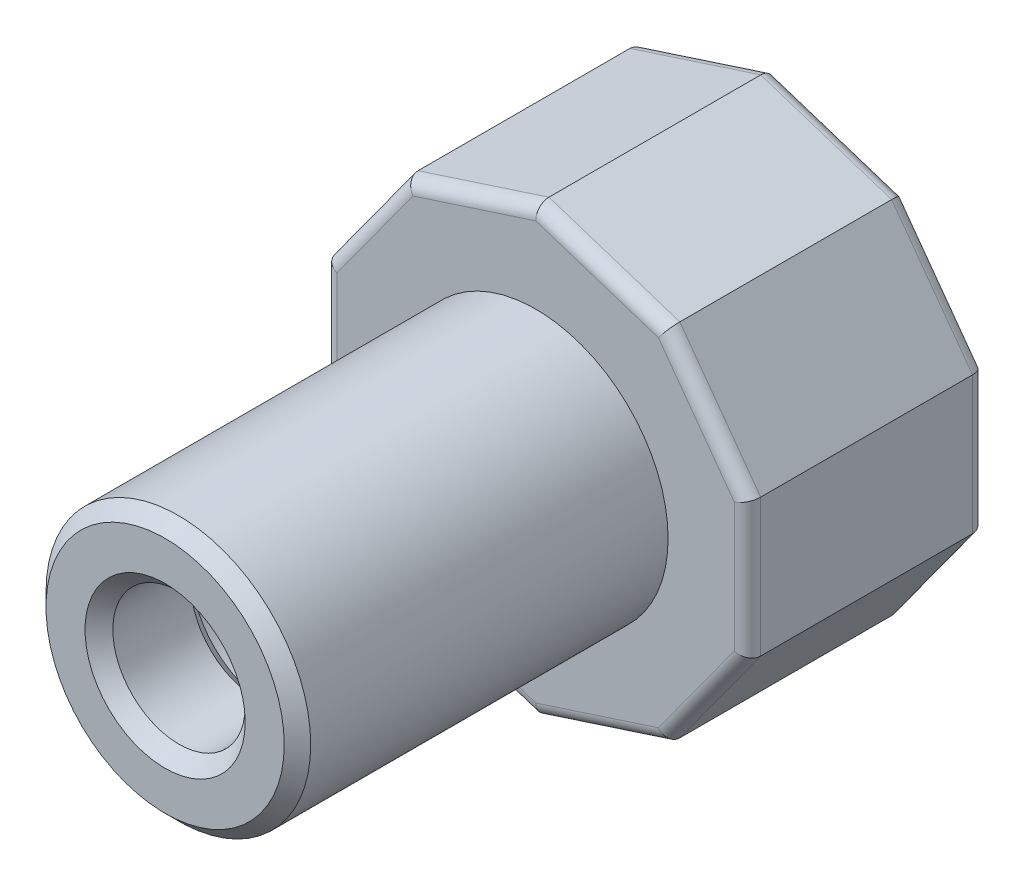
ISO-10303-21;
HEADER;
FILE_DESCRIPTION(('STEP AP214'),'2;1');
FILE_NAME('part.step','',(''),(''),'','','');
FILE_SCHEMA(('AUTOMOTIVE_DESIGN { 1 0 10303 214 1 1 1 1 }'));
ENDSEC;
DATA;
#1=APPLICATION_CONTEXT('core data for automotive mechanical design processes');
#2=APPLICATION_PROTOCOL_DEFINITION('international standard','automotive_design',2000,#1);
#3=PRODUCT_CONTEXT('',#1,'mechanical');
#4=PRODUCT('Part','Part','',(#3));
#5=PRODUCT_RELATED_PRODUCT_CATEGORY('part','',(#4));
#6=PRODUCT_DEFINITION_FORMATION('','',#4);
#7=PRODUCT_DEFINITION_CONTEXT('part definition',#1,'design');
#8=PRODUCT_DEFINITION('design','',#6,#7);
#9=PRODUCT_DEFINITION_SHAPE('','',#8);
#10=(LENGTH_UNIT() NAMED_UNIT(*) SI_UNIT(.MILLI.,.METRE.));
#11=(NAMED_UNIT(*) PLANE_ANGLE_UNIT() SI_UNIT($,.RADIAN.));
#12=(NAMED_UNIT(*) SI_UNIT($,.STERADIAN.) SOLID_ANGLE_UNIT());
#13=UNCERTAINTY_MEASURE_WITH_UNIT(LENGTH_MEASURE(1.E-05),#10,'distance_accuracy_value','');
#14=(GEOMETRIC_REPRESENTATION_CONTEXT(3) GLOBAL_UNCERTAINTY_ASSIGNED_CONTEXT((#13)) GLOBAL_UNIT_ASSIGNED_CONTEXT((#10,
#11,#12)) REPRESENTATION_CONTEXT('',''));
#15=CARTESIAN_POINT('',(0.,0.,0.));
#16=DIRECTION('',(0.,0.,1.));
#17=DIRECTION('',(1.,0.,0.));
#18=AXIS2_PLACEMENT_3D('',#15,#16,#17);
#19=CARTESIAN_POINT('',(0.,-8.41169779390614,9.));
#20=DIRECTION('',(-0.309016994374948,0.951056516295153,0.));
#21=DIRECTION('',(-0.951056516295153,-0.309016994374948,0.));
#22=AXIS2_PLACEMENT_3D('',#19,#20,#21);
#23=PLANE('',#22);
#24=DIRECTION('',(0.,0.,-1.));
#25=VECTOR('',#24,1.);
#26=CARTESIAN_POINT('',(4.94427190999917,-6.80520646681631,9.));
#27=LINE('',#26,#25);
#28=CARTESIAN_POINT('',(4.94427190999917,-6.80520646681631,8.5));
#29=VERTEX_POINT('',#28);
#30=CARTESIAN_POINT('',(4.94427190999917,-6.80520646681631,0.5));
#31=VERTEX_POINT('',#30);
#32=EDGE_CURVE('E322',#29,#31,#27,.T.);
#33=ORIENTED_EDGE('',*,*,#32,.F.);
#34=DIRECTION('',(0.951056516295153,0.309016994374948,0.));
#35=VECTOR('',#34,1.);
#36=CARTESIAN_POINT('',(0.,-8.41169779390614,8.5));
#37=LINE('',#36,#35);
#38=CARTESIAN_POINT('',(0.,-8.41169779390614,8.5));
#39=VERTEX_POINT('',#38);
#40=EDGE_CURVE('E266',#29,#39,#37,.F.);
#41=ORIENTED_EDGE('',*,*,#40,.T.);
#42=DIRECTION('',(0.,0.,-1.));
#43=VECTOR('',#42,1.);
#44=CARTESIAN_POINT('',(0.,-8.41169779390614,9.));
#45=LINE('',#44,#43);
#46=CARTESIAN_POINT('',(0.,-8.41169779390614,0.5));
#47=VERTEX_POINT('',#46);
#48=EDGE_CURVE('E323',#39,#47,#45,.T.);
#49=ORIENTED_EDGE('',*,*,#48,.T.);
#50=DIRECTION('',(0.951056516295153,0.309016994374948,0.));
#51=VECTOR('',#50,1.);
#52=CARTESIAN_POINT('',(0.,-8.41169779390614,0.5));
#53=LINE('',#52,#51);
#54=EDGE_CURVE('E272',#47,#31,#53,.T.);
#55=ORIENTED_EDGE('',*,*,#54,.T.);
#56=EDGE_LOOP('',(#33,#41,#49,#55));
#57=FACE_BOUND('',#56,.T.);
#58=ADVANCED_FACE('F35',(#57),#23,.F.);
#59=CARTESIAN_POINT('',(4.94427190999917,-6.80520646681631,9.));
#60=DIRECTION('',(-0.809016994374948,0.587785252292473,0.));
#61=DIRECTION('',(-0.587785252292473,-0.809016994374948,0.));
#62=AXIS2_PLACEMENT_3D('',#59,#60,#61);
#63=PLANE('',#62);
#64=DIRECTION('',(0.,0.,-1.));
#65=VECTOR('',#64,1.);
#66=CARTESIAN_POINT('',(8.,-2.59935756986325,9.));
#67=LINE('',#66,#65);
#68=CARTESIAN_POINT('',(8.,-2.59935756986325,8.5));
#69=VERTEX_POINT('',#68);
#70=CARTESIAN_POINT('',(8.,-2.59935756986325,0.5));
#71=VERTEX_POINT('',#70);
#72=EDGE_CURVE('E329',#69,#71,#67,.T.);
#73=ORIENTED_EDGE('',*,*,#72,.F.);
#74=DIRECTION('',(0.587785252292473,0.809016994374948,0.));
#75=VECTOR('',#74,1.);
#76=CARTESIAN_POINT('',(4.94427190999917,-6.80520646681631,8.5));
#77=LINE('',#76,#75);
#78=EDGE_CURVE('E201',#69,#29,#77,.F.);
#79=ORIENTED_EDGE('',*,*,#78,.T.);
#80=ORIENTED_EDGE('',*,*,#32,.T.);
#81=DIRECTION('',(0.587785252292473,0.809016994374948,0.));
#82=VECTOR('',#81,1.);
#83=CARTESIAN_POINT('',(4.94427190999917,-6.80520646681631,0.5));
#84=LINE('',#83,#82);
#85=EDGE_CURVE('E271',#31,#71,#84,.T.);
#86=ORIENTED_EDGE('',*,*,#85,.T.);
#87=EDGE_LOOP('',(#73,#79,#80,#86));
#88=FACE_BOUND('',#87,.T.);
#89=ADVANCED_FACE('F326',(#88),#63,.F.);
#90=CARTESIAN_POINT('',(8.,-2.59935756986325,9.));
#91=DIRECTION('',(-1.,0.,0.));
#92=DIRECTION('',(0.,0.,1.));
#93=AXIS2_PLACEMENT_3D('',#90,#91,#92);
#94=PLANE('',#93);
#95=DIRECTION('',(0.,0.,-1.));
#96=VECTOR('',#95,1.);
#97=CARTESIAN_POINT('',(8.,2.59935756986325,9.));
#98=LINE('',#97,#96);
#99=CARTESIAN_POINT('',(8.,2.59935756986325,8.5));
#100=VERTEX_POINT('',#99);
#101=CARTESIAN_POINT('',(8.,2.59935756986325,0.5));
#102=VERTEX_POINT('',#101);
#103=EDGE_CURVE('E334',#100,#102,#98,.T.);
#104=ORIENTED_EDGE('',*,*,#103,.F.);
#105=DIRECTION('',(0.,1.,0.));
#106=VECTOR('',#105,1.);
#107=CARTESIAN_POINT('',(8.,-2.59935756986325,8.5));
#108=LINE('',#107,#106);
#109=EDGE_CURVE('E291',#100,#69,#108,.F.);
#110=ORIENTED_EDGE('',*,*,#109,.T.);
#111=ORIENTED_EDGE('',*,*,#72,.T.);
#112=DIRECTION('',(0.,1.,0.));
#113=VECTOR('',#112,1.);
#114=CARTESIAN_POINT('',(8.,-2.59935756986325,0.5));
#115=LINE('',#114,#113);
#116=EDGE_CURVE('E288',#71,#102,#115,.T.);
#117=ORIENTED_EDGE('',*,*,#116,.T.);
#118=EDGE_LOOP('',(#104,#110,#111,#117));
#119=FACE_BOUND('',#118,.T.);
#120=ADVANCED_FACE('F413',(#119),#94,.F.);
#121=CARTESIAN_POINT('',(8.,2.59935756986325,9.));
#122=DIRECTION('',(-0.809016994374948,-0.587785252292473,0.));
#123=DIRECTION('',(0.587785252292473,-0.809016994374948,0.));
#124=AXIS2_PLACEMENT_3D('',#121,#122,#123);
#125=PLANE('',#124);
#126=DIRECTION('',(0.,0.,-1.));
#127=VECTOR('',#126,1.);
#128=CARTESIAN_POINT('',(4.94427190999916,6.80520646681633,9.));
#129=LINE('',#128,#127);
#130=CARTESIAN_POINT('',(4.94427190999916,6.80520646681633,8.5));
#131=VERTEX_POINT('',#130);
#132=CARTESIAN_POINT('',(4.94427190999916,6.80520646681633,0.5));
#133=VERTEX_POINT('',#132);
#134=EDGE_CURVE('E394',#131,#133,#129,.T.);
#135=ORIENTED_EDGE('',*,*,#134,.F.);
#136=DIRECTION('',(-0.587785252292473,0.809016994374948,0.));
#137=VECTOR('',#136,1.);
#138=CARTESIAN_POINT('',(8.,2.59935756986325,8.5));
#139=LINE('',#138,#137);
#140=EDGE_CURVE('E286',#131,#100,#139,.F.);
#141=ORIENTED_EDGE('',*,*,#140,.T.);
#142=ORIENTED_EDGE('',*,*,#103,.T.);
#143=DIRECTION('',(-0.587785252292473,0.809016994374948,0.));
#144=VECTOR('',#143,1.);
#145=CARTESIAN_POINT('',(8.,2.59935756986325,0.5));
#146=LINE('',#145,#144);
#147=EDGE_CURVE('E284',#102,#133,#146,.T.);
#148=ORIENTED_EDGE('',*,*,#147,.T.);
#149=EDGE_LOOP('',(#135,#141,#142,#148));
#150=FACE_BOUND('',#149,.T.);
#151=ADVANCED_FACE('F411',(#150),#125,.F.);
#152=CARTESIAN_POINT('',(4.94427190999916,6.80520646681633,9.));
#153=DIRECTION('',(-0.309016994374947,-0.951056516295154,0.));
#154=DIRECTION('',(0.951056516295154,-0.309016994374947,0.));
#155=AXIS2_PLACEMENT_3D('',#152,#153,#154);
#156=PLANE('',#155);
#157=DIRECTION('',(0.,0.,-1.));
#158=VECTOR('',#157,1.);
#159=CARTESIAN_POINT('',(0.,8.41169779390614,9.));
#160=LINE('',#159,#158);
#161=CARTESIAN_POINT('',(0.,8.41169779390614,8.5));
#162=VERTEX_POINT('',#161);
#163=CARTESIAN_POINT('',(0.,8.41169779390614,0.5));
#164=VERTEX_POINT('',#163);
#165=EDGE_CURVE('E382',#162,#164,#160,.T.);
#166=ORIENTED_EDGE('',*,*,#165,.F.);
#167=DIRECTION('',(-0.951056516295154,0.309016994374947,0.));
#168=VECTOR('',#167,1.);
#169=CARTESIAN_POINT('',(4.94427190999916,6.80520646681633,8.5));
#170=LINE('',#169,#168);
#171=EDGE_CURVE('E282',#162,#131,#170,.F.);
#172=ORIENTED_EDGE('',*,*,#171,.T.);
#173=ORIENTED_EDGE('',*,*,#134,.T.);
#174=DIRECTION('',(-0.951056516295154,0.309016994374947,0.));
#175=VECTOR('',#174,1.);
#176=CARTESIAN_POINT('',(4.94427190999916,6.80520646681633,0.5));
#177=LINE('',#176,#175);
#178=EDGE_CURVE('E280',#133,#164,#177,.T.);
#179=ORIENTED_EDGE('',*,*,#178,.T.);
#180=EDGE_LOOP('',(#166,#172,#173,#179));
#181=FACE_BOUND('',#180,.T.);
#182=ADVANCED_FACE('F390',(#181),#156,.F.);
#183=CARTESIAN_POINT('',(0.,8.41169779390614,9.));
#184=DIRECTION('',(0.309016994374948,-0.951056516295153,0.));
#185=DIRECTION('',(0.951056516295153,0.309016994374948,0.));
#186=AXIS2_PLACEMENT_3D('',#183,#184,#185);
#187=PLANE('',#186);
#188=DIRECTION('',(0.,0.,-1.));
#189=VECTOR('',#188,1.);
#190=CARTESIAN_POINT('',(-4.94427190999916,6.80520646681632,9.));
#191=LINE('',#190,#189);
#192=CARTESIAN_POINT('',(-4.94427190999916,6.80520646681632,8.5));
#193=VERTEX_POINT('',#192);
#194=CARTESIAN_POINT('',(-4.94427190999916,6.80520646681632,0.5));
#195=VERTEX_POINT('',#194);
#196=EDGE_CURVE('E385',#193,#195,#191,.T.);
#197=ORIENTED_EDGE('',*,*,#196,.F.);
#198=DIRECTION('',(-0.951056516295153,-0.309016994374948,0.));
#199=VECTOR('',#198,1.);
#200=CARTESIAN_POINT('',(0.,8.41169779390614,8.5));
#201=LINE('',#200,#199);
#202=EDGE_CURVE('E275',#193,#162,#201,.F.);
#203=ORIENTED_EDGE('',*,*,#202,.T.);
#204=ORIENTED_EDGE('',*,*,#165,.T.);
#205=DIRECTION('',(-0.951056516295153,-0.309016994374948,0.));
#206=VECTOR('',#205,1.);
#207=CARTESIAN_POINT('',(0.,8.41169779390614,0.5));
#208=LINE('',#207,#206);
#209=EDGE_CURVE('E375',#164,#195,#208,.T.);
#210=ORIENTED_EDGE('',*,*,#209,.T.);
#211=EDGE_LOOP('',(#197,#203,#204,#210));
#212=FACE_BOUND('',#211,.T.);
#213=ADVANCED_FACE('F381',(#212),#187,.F.);
#214=CARTESIAN_POINT('',(-4.94427190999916,6.80520646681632,9.));
#215=DIRECTION('',(0.809016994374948,-0.587785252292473,0.));
#216=DIRECTION('',(0.587785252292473,0.809016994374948,0.));
#217=AXIS2_PLACEMENT_3D('',#214,#215,#216);
#218=PLANE('',#217);
#219=DIRECTION('',(0.,0.,-1.));
#220=VECTOR('',#219,1.);
#221=CARTESIAN_POINT('',(-8.,2.59935756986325,9.));
#222=LINE('',#221,#220);
#223=CARTESIAN_POINT('',(-8.,2.59935756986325,8.5));
#224=VERTEX_POINT('',#223);
#225=CARTESIAN_POINT('',(-8.,2.59935756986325,0.5));
#226=VERTEX_POINT('',#225);
#227=EDGE_CURVE('E417',#224,#226,#222,.T.);
#228=ORIENTED_EDGE('',*,*,#227,.F.);
#229=DIRECTION('',(-0.587785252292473,-0.809016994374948,0.));
#230=VECTOR('',#229,1.);
#231=CARTESIAN_POINT('',(-4.94427190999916,6.80520646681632,8.5));
#232=LINE('',#231,#230);
#233=EDGE_CURVE('E373',#224,#193,#232,.F.);
#234=ORIENTED_EDGE('',*,*,#233,.T.);
#235=ORIENTED_EDGE('',*,*,#196,.T.);
#236=DIRECTION('',(-0.587785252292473,-0.809016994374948,0.));
#237=VECTOR('',#236,1.);
#238=CARTESIAN_POINT('',(-4.94427190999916,6.80520646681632,0.5));
#239=LINE('',#238,#237);
#240=EDGE_CURVE('E371',#195,#226,#239,.T.);
#241=ORIENTED_EDGE('',*,*,#240,.T.);
#242=EDGE_LOOP('',(#228,#234,#235,#241));
#243=FACE_BOUND('',#242,.T.);
#244=ADVANCED_FACE('F578',(#243),#218,.F.);
#245=CARTESIAN_POINT('',(-8.,2.59935756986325,9.));
#246=DIRECTION('',(1.,0.,0.));
#247=DIRECTION('',(0.,0.,-1.));
#248=AXIS2_PLACEMENT_3D('',#245,#246,#247);
#249=PLANE('',#248);
#250=DIRECTION('',(0.,0.,-1.));
#251=VECTOR('',#250,1.);
#252=CARTESIAN_POINT('',(-8.,-2.59935756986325,9.));
#253=LINE('',#252,#251);
#254=CARTESIAN_POINT('',(-8.,-2.59935756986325,8.5));
#255=VERTEX_POINT('',#254);
#256=CARTESIAN_POINT('',(-8.,-2.59935756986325,0.5));
#257=VERTEX_POINT('',#256);
#258=EDGE_CURVE('E420',#255,#257,#253,.T.);
#259=ORIENTED_EDGE('',*,*,#258,.F.);
#260=DIRECTION('',(0.,-1.,0.));
#261=VECTOR('',#260,1.);
#262=CARTESIAN_POINT('',(-8.,2.59935756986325,8.5));
#263=LINE('',#262,#261);
#264=EDGE_CURVE('E369',#255,#224,#263,.F.);
#265=ORIENTED_EDGE('',*,*,#264,.T.);
#266=ORIENTED_EDGE('',*,*,#227,.T.);
#267=DIRECTION('',(0.,-1.,0.));
#268=VECTOR('',#267,1.);
#269=CARTESIAN_POINT('',(-8.,2.59935756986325,0.5));
#270=LINE('',#269,#268);
#271=EDGE_CURVE('E367',#226,#257,#270,.T.);
#272=ORIENTED_EDGE('',*,*,#271,.T.);
#273=EDGE_LOOP('',(#259,#265,#266,#272));
#274=FACE_BOUND('',#273,.T.);
#275=ADVANCED_FACE('F570',(#274),#249,.F.);
#276=CARTESIAN_POINT('',(-8.,-2.59935756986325,9.));
#277=DIRECTION('',(0.809016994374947,0.587785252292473,0.));
#278=DIRECTION('',(-0.587785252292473,0.809016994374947,0.));
#279=AXIS2_PLACEMENT_3D('',#276,#277,#278);
#280=PLANE('',#279);
#281=DIRECTION('',(0.,0.,-1.));
#282=VECTOR('',#281,1.);
#283=CARTESIAN_POINT('',(-4.94427190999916,-6.80520646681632,9.));
#284=LINE('',#283,#282);
#285=CARTESIAN_POINT('',(-4.94427190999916,-6.80520646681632,8.5));
#286=VERTEX_POINT('',#285);
#287=CARTESIAN_POINT('',(-4.94427190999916,-6.80520646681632,0.5));
#288=VERTEX_POINT('',#287);
#289=EDGE_CURVE('E423',#286,#288,#284,.T.);
#290=ORIENTED_EDGE('',*,*,#289,.F.);
#291=DIRECTION('',(0.587785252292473,-0.809016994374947,0.));
#292=VECTOR('',#291,1.);
#293=CARTESIAN_POINT('',(-8.,-2.59935756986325,8.5));
#294=LINE('',#293,#292);
#295=EDGE_CURVE('E365',#286,#255,#294,.F.);
#296=ORIENTED_EDGE('',*,*,#295,.T.);
#297=ORIENTED_EDGE('',*,*,#258,.T.);
#298=DIRECTION('',(0.587785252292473,-0.809016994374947,0.));
#299=VECTOR('',#298,1.);
#300=CARTESIAN_POINT('',(-8.,-2.59935756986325,0.5));
#301=LINE('',#300,#299);
#302=EDGE_CURVE('E363',#257,#288,#301,.T.);
#303=ORIENTED_EDGE('',*,*,#302,.T.);
#304=EDGE_LOOP('',(#290,#296,#297,#303));
#305=FACE_BOUND('',#304,.T.);
#306=ADVANCED_FACE('F565',(#305),#280,.F.);
#307=CARTESIAN_POINT('',(-4.94427190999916,-6.80520646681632,9.));
#308=DIRECTION('',(0.309016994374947,0.951056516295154,0.));
#309=DIRECTION('',(-0.951056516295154,0.309016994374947,0.));
#310=AXIS2_PLACEMENT_3D('',#307,#308,#309);
#311=PLANE('',#310);
#312=ORIENTED_EDGE('',*,*,#48,.F.);
#313=DIRECTION('',(0.951056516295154,-0.309016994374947,0.));
#314=VECTOR('',#313,1.);
#315=CARTESIAN_POINT('',(-4.94427190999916,-6.80520646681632,8.5));
#316=LINE('',#315,#314);
#317=EDGE_CURVE('E360',#39,#286,#316,.F.);
#318=ORIENTED_EDGE('',*,*,#317,.T.);
#319=ORIENTED_EDGE('',*,*,#289,.T.);
#320=DIRECTION('',(0.951056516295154,-0.309016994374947,0.));
#321=VECTOR('',#320,1.);
#322=CARTESIAN_POINT('',(-4.94427190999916,-6.80520646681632,0.5));
#323=LINE('',#322,#321);
#324=EDGE_CURVE('E358',#288,#47,#323,.T.);
#325=ORIENTED_EDGE('',*,*,#324,.T.);
#326=EDGE_LOOP('',(#312,#318,#319,#325));
#327=FACE_BOUND('',#326,.T.);
#328=ADVANCED_FACE('F562',(#327),#311,.F.);
#329=CARTESIAN_POINT('',(0.,0.,9.));
#330=DIRECTION('',(0.,0.,1.));
#331=DIRECTION('',(1.,0.,0.));
#332=AXIS2_PLACEMENT_3D('',#329,#330,#331);
#333=PLANE('',#332);
#334=DIRECTION('',(0.587785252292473,-0.809016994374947,0.));
#335=VECTOR('',#334,1.);
#336=CARTESIAN_POINT('',(-4.53976341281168,-6.51131384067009,9.));
#337=LINE('',#336,#335);
#338=CARTESIAN_POINT('',(-7.5,-2.4368977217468,9.));
#339=VERTEX_POINT('',#338);
#340=CARTESIAN_POINT('',(-4.63525491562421,-6.3798810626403,9.));
#341=VERTEX_POINT('',#340);
#342=EDGE_CURVE('E354',#339,#341,#337,.T.);
#343=ORIENTED_EDGE('',*,*,#342,.T.);
#344=DIRECTION('',(0.951056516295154,-0.309016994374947,0.));
#345=VECTOR('',#344,1.);
#346=CARTESIAN_POINT('',(0.154508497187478,-7.93616953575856,9.));
#347=LINE('',#346,#345);
#348=CARTESIAN_POINT('',(0.,-7.885966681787,9.));
#349=VERTEX_POINT('',#348);
#350=EDGE_CURVE('E356',#341,#349,#347,.T.);
#351=ORIENTED_EDGE('',*,*,#350,.T.);
#352=DIRECTION('',(0.951056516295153,0.309016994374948,0.));
#353=VECTOR('',#352,1.);
#354=CARTESIAN_POINT('',(4.78976341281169,-6.32967820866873,9.));
#355=LINE('',#354,#353);
#356=CARTESIAN_POINT('',(4.63525491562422,-6.37988106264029,9.));
#357=VERTEX_POINT('',#356);
#358=EDGE_CURVE('E181',#349,#357,#355,.T.);
#359=ORIENTED_EDGE('',*,*,#358,.T.);
#360=DIRECTION('',(0.587785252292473,0.809016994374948,0.));
#361=VECTOR('',#360,1.);
#362=CARTESIAN_POINT('',(7.59549150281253,-2.30546494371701,9.));
#363=LINE('',#362,#361);
#364=CARTESIAN_POINT('',(7.5,-2.4368977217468,9.));
#365=VERTEX_POINT('',#364);
#366=EDGE_CURVE('E173',#357,#365,#363,.T.);
#367=ORIENTED_EDGE('',*,*,#366,.T.);
#368=DIRECTION('',(0.,1.,0.));
#369=VECTOR('',#368,1.);
#370=CARTESIAN_POINT('',(7.5,2.59935756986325,9.));
#371=LINE('',#370,#369);
#372=CARTESIAN_POINT('',(7.5,2.4368977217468,9.));
#373=VERTEX_POINT('',#372);
#374=EDGE_CURVE('E177',#365,#373,#371,.T.);
#375=ORIENTED_EDGE('',*,*,#374,.T.);
#376=DIRECTION('',(-0.587785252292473,0.809016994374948,0.));
#377=VECTOR('',#376,1.);
#378=CARTESIAN_POINT('',(4.53976341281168,6.51131384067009,9.));
#379=LINE('',#378,#377);
#380=CARTESIAN_POINT('',(4.63525491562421,6.37988106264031,9.));
#381=VERTEX_POINT('',#380);
#382=EDGE_CURVE('E197',#373,#381,#379,.T.);
#383=ORIENTED_EDGE('',*,*,#382,.T.);
#384=DIRECTION('',(-0.951056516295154,0.309016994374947,0.));
#385=VECTOR('',#384,1.);
#386=CARTESIAN_POINT('',(-0.154508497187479,7.93616953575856,9.));
#387=LINE('',#386,#385);
#388=CARTESIAN_POINT('',(0.,7.88596668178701,9.));
#389=VERTEX_POINT('',#388);
#390=EDGE_CURVE('E186',#381,#389,#387,.T.);
#391=ORIENTED_EDGE('',*,*,#390,.T.);
#392=DIRECTION('',(-0.951056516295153,-0.309016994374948,0.));
#393=VECTOR('',#392,1.);
#394=CARTESIAN_POINT('',(-4.78976341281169,6.32967820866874,9.));
#395=LINE('',#394,#393);
#396=CARTESIAN_POINT('',(-4.63525491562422,6.3798810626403,9.));
#397=VERTEX_POINT('',#396);
#398=EDGE_CURVE('E348',#389,#397,#395,.T.);
#399=ORIENTED_EDGE('',*,*,#398,.T.);
#400=DIRECTION('',(-0.587785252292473,-0.809016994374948,0.));
#401=VECTOR('',#400,1.);
#402=CARTESIAN_POINT('',(-7.59549150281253,2.30546494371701,9.));
#403=LINE('',#402,#401);
#404=CARTESIAN_POINT('',(-7.5,2.4368977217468,9.));
#405=VERTEX_POINT('',#404);
#406=EDGE_CURVE('E350',#397,#405,#403,.T.);
#407=ORIENTED_EDGE('',*,*,#406,.T.);
#408=DIRECTION('',(0.,-1.,0.));
#409=VECTOR('',#408,1.);
#410=CARTESIAN_POINT('',(-7.5,-2.59935756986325,9.));
#411=LINE('',#410,#409);
#412=EDGE_CURVE('E352',#405,#339,#411,.T.);
#413=ORIENTED_EDGE('',*,*,#412,.T.);
#414=EDGE_LOOP('',(#343,#351,#359,#367,#375,#383,#391,#399,#407,#413));
#415=FACE_BOUND('',#414,.T.);
#416=CARTESIAN_POINT('',(0.,0.,9.));
#417=DIRECTION('',(0.,0.,1.));
#418=DIRECTION('',(1.,0.,0.));
#419=AXIS2_PLACEMENT_3D('',#416,#417,#418);
#420=CIRCLE('',#419,5.);
#421=CARTESIAN_POINT('',(5.,0.,9.));
#422=VERTEX_POINT('',#421);
#423=EDGE_CURVE('E427',#422,#422,#420,.T.);
#424=ORIENTED_EDGE('',*,*,#423,.F.);
#425=EDGE_LOOP('',(#424));
#426=FACE_BOUND('',#425,.T.);
#427=ADVANCED_FACE('F175',(#415,#426),#333,.T.);
#428=CARTESIAN_POINT('',(0.,0.,0.));
#429=DIRECTION('',(0.,0.,1.));
#430=DIRECTION('',(1.,0.,0.));
#431=AXIS2_PLACEMENT_3D('',#428,#429,#430);
#432=PLANE('',#431);
#433=DIRECTION('',(-0.587785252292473,0.809016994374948,0.));
#434=VECTOR('',#433,1.);
#435=CARTESIAN_POINT('',(6.06762745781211,4.40838939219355,0.));
#436=LINE('',#435,#434);
#437=CARTESIAN_POINT('',(4.63525491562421,6.37988106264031,0.));
#438=VERTEX_POINT('',#437);
#439=CARTESIAN_POINT('',(7.5,2.4368977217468,0.));
#440=VERTEX_POINT('',#439);
#441=EDGE_CURVE('E293',#438,#440,#436,.F.);
#442=ORIENTED_EDGE('',*,*,#441,.T.);
#443=DIRECTION('',(0.,1.,0.));
#444=VECTOR('',#443,1.);
#445=CARTESIAN_POINT('',(7.5,0.,0.));
#446=LINE('',#445,#444);
#447=CARTESIAN_POINT('',(7.5,-2.4368977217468,0.));
#448=VERTEX_POINT('',#447);
#449=EDGE_CURVE('E11',#440,#448,#446,.F.);
#450=ORIENTED_EDGE('',*,*,#449,.T.);
#451=DIRECTION('',(0.587785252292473,0.809016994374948,0.));
#452=VECTOR('',#451,1.);
#453=CARTESIAN_POINT('',(6.06762745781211,-4.40838939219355,0.));
#454=LINE('',#453,#452);
#455=CARTESIAN_POINT('',(4.63525491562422,-6.37988106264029,0.));
#456=VERTEX_POINT('',#455);
#457=EDGE_CURVE('E44',#448,#456,#454,.F.);
#458=ORIENTED_EDGE('',*,*,#457,.T.);
#459=DIRECTION('',(0.951056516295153,0.309016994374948,0.));
#460=VECTOR('',#459,1.);
#461=CARTESIAN_POINT('',(2.31762745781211,-7.13292387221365,0.));
#462=LINE('',#461,#460);
#463=CARTESIAN_POINT('',(0.,-7.885966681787,0.));
#464=VERTEX_POINT('',#463);
#465=EDGE_CURVE('E307',#456,#464,#462,.F.);
#466=ORIENTED_EDGE('',*,*,#465,.T.);
#467=DIRECTION('',(0.951056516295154,-0.309016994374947,0.));
#468=VECTOR('',#467,1.);
#469=CARTESIAN_POINT('',(-2.3176274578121,-7.13292387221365,0.));
#470=LINE('',#469,#468);
#471=CARTESIAN_POINT('',(-4.63525491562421,-6.3798810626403,0.));
#472=VERTEX_POINT('',#471);
#473=EDGE_CURVE('E305',#464,#472,#470,.F.);
#474=ORIENTED_EDGE('',*,*,#473,.T.);
#475=DIRECTION('',(0.587785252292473,-0.809016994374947,0.));
#476=VECTOR('',#475,1.);
#477=CARTESIAN_POINT('',(-6.0676274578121,-4.40838939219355,0.));
#478=LINE('',#477,#476);
#479=CARTESIAN_POINT('',(-7.5,-2.4368977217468,0.));
#480=VERTEX_POINT('',#479);
#481=EDGE_CURVE('E303',#472,#480,#478,.F.);
#482=ORIENTED_EDGE('',*,*,#481,.T.);
#483=DIRECTION('',(0.,-1.,0.));
#484=VECTOR('',#483,1.);
#485=CARTESIAN_POINT('',(-7.5,0.,0.));
#486=LINE('',#485,#484);
#487=CARTESIAN_POINT('',(-7.5,2.4368977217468,0.));
#488=VERTEX_POINT('',#487);
#489=EDGE_CURVE('E301',#480,#488,#486,.F.);
#490=ORIENTED_EDGE('',*,*,#489,.T.);
#491=DIRECTION('',(-0.587785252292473,-0.809016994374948,0.));
#492=VECTOR('',#491,1.);
#493=CARTESIAN_POINT('',(-6.06762745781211,4.40838939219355,0.));
#494=LINE('',#493,#492);
#495=CARTESIAN_POINT('',(-4.63525491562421,6.3798810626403,0.));
#496=VERTEX_POINT('',#495);
#497=EDGE_CURVE('E299',#488,#496,#494,.F.);
#498=ORIENTED_EDGE('',*,*,#497,.T.);
#499=DIRECTION('',(-0.951056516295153,-0.309016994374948,0.));
#500=VECTOR('',#499,1.);
#501=CARTESIAN_POINT('',(-2.31762745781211,7.13292387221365,0.));
#502=LINE('',#501,#500);
#503=CARTESIAN_POINT('',(0.,7.88596668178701,0.));
#504=VERTEX_POINT('',#503);
#505=EDGE_CURVE('E297',#496,#504,#502,.F.);
#506=ORIENTED_EDGE('',*,*,#505,.T.);
#507=DIRECTION('',(-0.951056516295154,0.309016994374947,0.));
#508=VECTOR('',#507,1.);
#509=CARTESIAN_POINT('',(2.3176274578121,7.13292387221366,0.));
#510=LINE('',#509,#508);
#511=EDGE_CURVE('E295',#504,#438,#510,.F.);
#512=ORIENTED_EDGE('',*,*,#511,.T.);
#513=EDGE_LOOP('',(#442,#450,#458,#466,#474,#482,#490,#498,#506,#512));
#514=FACE_BOUND('',#513,.T.);
#515=CARTESIAN_POINT('',(0.,0.,0.));
#516=DIRECTION('',(0.,0.,1.));
#517=DIRECTION('',(1.,0.,0.));
#518=AXIS2_PLACEMENT_3D('',#515,#516,#517);
#519=CIRCLE('',#518,3.875);
#520=CARTESIAN_POINT('',(3.875,0.,0.));
#521=VERTEX_POINT('',#520);
#522=EDGE_CURVE('E332',#521,#521,#519,.T.);
#523=ORIENTED_EDGE('',*,*,#522,.T.);
#524=EDGE_LOOP('',(#523));
#525=FACE_BOUND('',#524,.T.);
#526=ADVANCED_FACE('F309',(#514,#525),#432,.F.);
#527=CARTESIAN_POINT('',(0.,0.,23.));
#528=DIRECTION('',(0.,0.,-1.));
#529=DIRECTION('',(-1.,0.,0.));
#530=AXIS2_PLACEMENT_3D('',#527,#528,#529);
#531=CYLINDRICAL_SURFACE('',#530,5.);
#532=CARTESIAN_POINT('',(0.,0.,22.5));
#533=DIRECTION('',(0.,0.,1.));
#534=DIRECTION('',(1.,0.,0.));
#535=AXIS2_PLACEMENT_3D('',#532,#533,#534);
#536=CIRCLE('',#535,5.);
#537=CARTESIAN_POINT('',(5.,0.,22.5));
#538=VERTEX_POINT('',#537);
#539=EDGE_CURVE('E198',#538,#538,#536,.F.);
#540=ORIENTED_EDGE('',*,*,#539,.T.);
#541=EDGE_LOOP('',(#540));
#542=FACE_BOUND('',#541,.T.);
#543=ORIENTED_EDGE('',*,*,#423,.T.);
#544=EDGE_LOOP('',(#543));
#545=FACE_BOUND('',#544,.T.);
#546=ADVANCED_FACE('F470',(#542,#545),#531,.T.);
#547=CARTESIAN_POINT('',(0.,0.,23.));
#548=DIRECTION('',(0.,0.,1.));
#549=DIRECTION('',(1.,0.,0.));
#550=AXIS2_PLACEMENT_3D('',#547,#548,#549);
#551=PLANE('',#550);
#552=CARTESIAN_POINT('',(0.,0.,23.));
#553=DIRECTION('',(0.,0.,1.));
#554=DIRECTION('',(1.,0.,0.));
#555=AXIS2_PLACEMENT_3D('',#552,#553,#554);
#556=CIRCLE('',#555,4.50000000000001);
#557=CARTESIAN_POINT('',(4.50000000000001,0.,23.));
#558=VERTEX_POINT('',#557);
#559=EDGE_CURVE('E340',#558,#558,#556,.T.);
#560=ORIENTED_EDGE('',*,*,#559,.T.);
#561=EDGE_LOOP('',(#560));
#562=FACE_BOUND('',#561,.T.);
#563=CARTESIAN_POINT('',(0.,0.,23.));
#564=DIRECTION('',(0.,0.,1.));
#565=DIRECTION('',(1.,0.,0.));
#566=AXIS2_PLACEMENT_3D('',#563,#564,#565);
#567=CIRCLE('',#566,3.025);
#568=CARTESIAN_POINT('',(3.025,0.,23.));
#569=VERTEX_POINT('',#568);
#570=EDGE_CURVE('E439',#569,#569,#567,.T.);
#571=ORIENTED_EDGE('',*,*,#570,.F.);
#572=EDGE_LOOP('',(#571));
#573=FACE_BOUND('',#572,.T.);
#574=ADVANCED_FACE('F467',(#562,#573),#551,.T.);
#575=CARTESIAN_POINT('',(0.,0.,19.));
#576=DIRECTION('',(0.,0.,-1.));
#577=DIRECTION('',(-1.,0.,0.));
#578=AXIS2_PLACEMENT_3D('',#575,#576,#577);
#579=CYLINDRICAL_SURFACE('',#578,3.375);
#580=CARTESIAN_POINT('',(0.,0.,0.5));
#581=DIRECTION('',(0.,0.,1.));
#582=DIRECTION('',(1.,0.,0.));
#583=AXIS2_PLACEMENT_3D('',#580,#581,#582);
#584=CIRCLE('',#583,3.375);
#585=CARTESIAN_POINT('',(3.375,0.,0.5));
#586=VERTEX_POINT('',#585);
#587=EDGE_CURVE('E328',#586,#586,#584,.F.);
#588=ORIENTED_EDGE('',*,*,#587,.T.);
#589=EDGE_LOOP('',(#588));
#590=FACE_BOUND('',#589,.T.);
#591=CARTESIAN_POINT('',(0.,0.,19.));
#592=DIRECTION('',(0.,0.,-1.));
#593=DIRECTION('',(-1.,0.,0.));
#594=AXIS2_PLACEMENT_3D('',#591,#592,#593);
#595=CIRCLE('',#594,3.375);
#596=CARTESIAN_POINT('',(-3.375,0.,19.));
#597=VERTEX_POINT('',#596);
#598=EDGE_CURVE('E430',#597,#597,#595,.T.);
#599=ORIENTED_EDGE('',*,*,#598,.F.);
#600=EDGE_LOOP('',(#599));
#601=FACE_BOUND('',#600,.T.);
#602=ADVANCED_FACE('F469',(#590,#601),#579,.F.);
#603=CARTESIAN_POINT('',(0.,0.,19.));
#604=DIRECTION('',(0.,0.,-1.));
#605=DIRECTION('',(-1.,0.,0.));
#606=AXIS2_PLACEMENT_3D('',#603,#604,#605);
#607=PLANE('',#606);
#608=CARTESIAN_POINT('',(0.,0.,19.));
#609=DIRECTION('',(0.,0.,1.));
#610=DIRECTION('',(1.,0.,0.));
#611=AXIS2_PLACEMENT_3D('',#608,#609,#610);
#612=CIRCLE('',#611,3.025);
#613=CARTESIAN_POINT('',(3.025,0.,19.));
#614=VERTEX_POINT('',#613);
#615=EDGE_CURVE('E222',#614,#614,#612,.T.);
#616=ORIENTED_EDGE('',*,*,#615,.T.);
#617=EDGE_LOOP('',(#616));
#618=FACE_BOUND('',#617,.T.);
#619=ORIENTED_EDGE('',*,*,#598,.T.);
#620=EDGE_LOOP('',(#619));
#621=FACE_BOUND('',#620,.T.);
#622=ADVANCED_FACE('F445',(#618,#621),#607,.T.);
#623=CARTESIAN_POINT('',(0.,0.,19.525));
#624=DIRECTION('',(0.,0.,-1.));
#625=DIRECTION('',(-1.,0.,0.));
#626=AXIS2_PLACEMENT_3D('',#623,#624,#625);
#627=CONICAL_SURFACE('',#626,2.5,0.785398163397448);
#628=ORIENTED_EDGE('',*,*,#615,.F.);
#629=EDGE_LOOP('',(#628));
#630=FACE_BOUND('',#629,.T.);
#631=CARTESIAN_POINT('',(0.,0.,19.525));
#632=DIRECTION('',(0.,0.,1.));
#633=DIRECTION('',(1.,0.,0.));
#634=AXIS2_PLACEMENT_3D('',#631,#632,#633);
#635=CIRCLE('',#634,2.5);
#636=CARTESIAN_POINT('',(2.5,0.,19.525));
#637=VERTEX_POINT('',#636);
#638=EDGE_CURVE('E433',#637,#637,#635,.T.);
#639=ORIENTED_EDGE('',*,*,#638,.T.);
#640=EDGE_LOOP('',(#639));
#641=FACE_BOUND('',#640,.T.);
#642=ADVANCED_FACE('F448',(#630,#641),#627,.F.);
#643=CARTESIAN_POINT('',(0.,0.,23.));
#644=DIRECTION('',(0.,0.,1.));
#645=DIRECTION('',(1.,0.,0.));
#646=AXIS2_PLACEMENT_3D('',#643,#644,#645);
#647=CYLINDRICAL_SURFACE('',#646,2.5);
#648=ORIENTED_EDGE('',*,*,#638,.F.);
#649=EDGE_LOOP('',(#648));
#650=FACE_BOUND('',#649,.T.);
#651=CARTESIAN_POINT('',(0.,0.,22.475));
#652=DIRECTION('',(0.,0.,1.));
#653=DIRECTION('',(1.,0.,0.));
#654=AXIS2_PLACEMENT_3D('',#651,#652,#653);
#655=CIRCLE('',#654,2.5);
#656=CARTESIAN_POINT('',(2.5,0.,22.475));
#657=VERTEX_POINT('',#656);
#658=EDGE_CURVE('E436',#657,#657,#655,.T.);
#659=ORIENTED_EDGE('',*,*,#658,.T.);
#660=EDGE_LOOP('',(#659));
#661=FACE_BOUND('',#660,.T.);
#662=ADVANCED_FACE('F451',(#650,#661),#647,.F.);
#663=CARTESIAN_POINT('',(0.,0.,23.));
#664=DIRECTION('',(0.,0.,1.));
#665=DIRECTION('',(1.,0.,0.));
#666=AXIS2_PLACEMENT_3D('',#663,#664,#665);
#667=CONICAL_SURFACE('',#666,3.025,0.785398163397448);
#668=ORIENTED_EDGE('',*,*,#658,.F.);
#669=EDGE_LOOP('',(#668));
#670=FACE_BOUND('',#669,.T.);
#671=ORIENTED_EDGE('',*,*,#570,.T.);
#672=EDGE_LOOP('',(#671));
#673=FACE_BOUND('',#672,.T.);
#674=ADVANCED_FACE('F457',(#670,#673),#667,.F.);
#675=CARTESIAN_POINT('',(0.,0.,0.5));
#676=DIRECTION('',(0.,0.,-1.));
#677=DIRECTION('',(-1.,0.,0.));
#678=AXIS2_PLACEMENT_3D('',#675,#676,#677);
#679=CONICAL_SURFACE('',#678,3.375,0.785398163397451);
#680=ORIENTED_EDGE('',*,*,#522,.F.);
#681=EDGE_LOOP('',(#680));
#682=FACE_BOUND('',#681,.T.);
#683=ORIENTED_EDGE('',*,*,#587,.F.);
#684=EDGE_LOOP('',(#683));
#685=FACE_BOUND('',#684,.T.);
#686=ADVANCED_FACE('F463',(#682,#685),#679,.F.);
#687=CARTESIAN_POINT('',(0.,0.,23.));
#688=DIRECTION('',(0.,0.,-1.));
#689=DIRECTION('',(-1.,0.,0.));
#690=AXIS2_PLACEMENT_3D('',#687,#688,#689);
#691=CONICAL_SURFACE('',#690,4.50000000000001,0.785398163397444);
#692=ORIENTED_EDGE('',*,*,#539,.F.);
#693=EDGE_LOOP('',(#692));
#694=FACE_BOUND('',#693,.T.);
#695=ORIENTED_EDGE('',*,*,#559,.F.);
#696=EDGE_LOOP('',(#695));
#697=FACE_BOUND('',#696,.T.);
#698=ADVANCED_FACE('F491',(#694,#697),#691,.T.);
#699=CARTESIAN_POINT('',(2.3176274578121,7.13292387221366,8.5));
#700=DIRECTION('',(0.951056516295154,-0.309016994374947,0.));
#701=DIRECTION('',(0.309016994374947,0.951056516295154,0.));
#702=AXIS2_PLACEMENT_3D('',#699,#700,#701);
#703=CYLINDRICAL_SURFACE('',#702,0.5);
#704=CARTESIAN_POINT('',(4.63525491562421,6.37988106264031,8.5));
#705=DIRECTION('',(0.809016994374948,-0.587785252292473,0.));
#706=DIRECTION('',(-0.587785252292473,-0.809016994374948,0.));
#707=AXIS2_PLACEMENT_3D('',#704,#705,#706);
#708=ELLIPSE('',#707,0.525731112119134,0.5);
#709=EDGE_CURVE('E216',#131,#381,#708,.T.);
#710=ORIENTED_EDGE('',*,*,#709,.F.);
#711=ORIENTED_EDGE('',*,*,#171,.F.);
#712=CARTESIAN_POINT('',(0.,7.88596668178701,8.5));
#713=DIRECTION('',(1.,0.,0.));
#714=DIRECTION('',(0.,-1.,0.));
#715=AXIS2_PLACEMENT_3D('',#712,#713,#714);
#716=ELLIPSE('',#715,0.525731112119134,0.5);
#717=EDGE_CURVE('E219',#389,#162,#716,.F.);
#718=ORIENTED_EDGE('',*,*,#717,.F.);
#719=ORIENTED_EDGE('',*,*,#390,.F.);
#720=EDGE_LOOP('',(#710,#711,#718,#719));
#721=FACE_BOUND('',#720,.T.);
#722=ADVANCED_FACE('F399',(#721),#703,.T.);
#723=CARTESIAN_POINT('',(-2.31762745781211,7.13292387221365,8.5));
#724=DIRECTION('',(0.951056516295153,0.309016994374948,0.));
#725=DIRECTION('',(-0.309016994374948,0.951056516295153,0.));
#726=AXIS2_PLACEMENT_3D('',#723,#724,#725);
#727=CYLINDRICAL_SURFACE('',#726,0.5);
#728=ORIENTED_EDGE('',*,*,#717,.T.);
#729=ORIENTED_EDGE('',*,*,#202,.F.);
#730=CARTESIAN_POINT('',(-4.63525491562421,6.3798810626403,8.5));
#731=DIRECTION('',(0.809016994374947,0.587785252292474,0.));
#732=DIRECTION('',(0.587785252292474,-0.809016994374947,0.));
#733=AXIS2_PLACEMENT_3D('',#730,#731,#732);
#734=ELLIPSE('',#733,0.525731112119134,0.5);
#735=EDGE_CURVE('E213',#397,#193,#734,.F.);
#736=ORIENTED_EDGE('',*,*,#735,.F.);
#737=ORIENTED_EDGE('',*,*,#398,.F.);
#738=EDGE_LOOP('',(#728,#729,#736,#737));
#739=FACE_BOUND('',#738,.T.);
#740=ADVANCED_FACE('F403',(#739),#727,.T.);
#741=CARTESIAN_POINT('',(6.06762745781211,4.40838939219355,8.5));
#742=DIRECTION('',(0.587785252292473,-0.809016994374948,0.));
#743=DIRECTION('',(0.809016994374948,0.587785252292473,0.));
#744=AXIS2_PLACEMENT_3D('',#741,#742,#743);
#745=CYLINDRICAL_SURFACE('',#744,0.5);
#746=ORIENTED_EDGE('',*,*,#709,.T.);
#747=ORIENTED_EDGE('',*,*,#382,.F.);
#748=CARTESIAN_POINT('',(7.5,2.43689772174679,8.5));
#749=DIRECTION('',(0.309016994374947,-0.951056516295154,0.));
#750=DIRECTION('',(-0.951056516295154,-0.309016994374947,0.));
#751=AXIS2_PLACEMENT_3D('',#748,#749,#750);
#752=ELLIPSE('',#751,0.525731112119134,0.5);
#753=EDGE_CURVE('E196',#100,#373,#752,.T.);
#754=ORIENTED_EDGE('',*,*,#753,.F.);
#755=ORIENTED_EDGE('',*,*,#140,.F.);
#756=EDGE_LOOP('',(#746,#747,#754,#755));
#757=FACE_BOUND('',#756,.T.);
#758=ADVANCED_FACE('F407',(#757),#745,.T.);
#759=CARTESIAN_POINT('',(-6.06762745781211,4.40838939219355,8.5));
#760=DIRECTION('',(0.587785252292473,0.809016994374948,0.));
#761=DIRECTION('',(-0.809016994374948,0.587785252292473,0.));
#762=AXIS2_PLACEMENT_3D('',#759,#760,#761);
#763=CYLINDRICAL_SURFACE('',#762,0.5);
#764=ORIENTED_EDGE('',*,*,#735,.T.);
#765=ORIENTED_EDGE('',*,*,#233,.F.);
#766=CARTESIAN_POINT('',(-7.5,2.4368977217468,8.5));
#767=DIRECTION('',(0.309016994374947,0.951056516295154,0.));
#768=DIRECTION('',(0.951056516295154,-0.309016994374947,0.));
#769=AXIS2_PLACEMENT_3D('',#766,#767,#768);
#770=ELLIPSE('',#769,0.525731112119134,0.5);
#771=EDGE_CURVE('E202',#405,#224,#770,.F.);
#772=ORIENTED_EDGE('',*,*,#771,.F.);
#773=ORIENTED_EDGE('',*,*,#406,.F.);
#774=EDGE_LOOP('',(#764,#765,#772,#773));
#775=FACE_BOUND('',#774,.T.);
#776=ADVANCED_FACE('F513',(#775),#763,.T.);
#777=CARTESIAN_POINT('',(7.5,0.,8.5));
#778=DIRECTION('',(0.,-1.,0.));
#779=DIRECTION('',(0.,0.,-1.));
#780=AXIS2_PLACEMENT_3D('',#777,#778,#779);
#781=CYLINDRICAL_SURFACE('',#780,0.5);
#782=ORIENTED_EDGE('',*,*,#753,.T.);
#783=ORIENTED_EDGE('',*,*,#374,.F.);
#784=CARTESIAN_POINT('',(7.5,-2.4368977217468,8.5));
#785=DIRECTION('',(-0.309016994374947,-0.951056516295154,0.));
#786=DIRECTION('',(0.951056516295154,-0.309016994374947,0.));
#787=AXIS2_PLACEMENT_3D('',#784,#785,#786);
#788=ELLIPSE('',#787,0.525731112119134,0.5);
#789=EDGE_CURVE('E193',#69,#365,#788,.T.);
#790=ORIENTED_EDGE('',*,*,#789,.F.);
#791=ORIENTED_EDGE('',*,*,#109,.F.);
#792=EDGE_LOOP('',(#782,#783,#790,#791));
#793=FACE_BOUND('',#792,.T.);
#794=ADVANCED_FACE('F191',(#793),#781,.T.);
#795=CARTESIAN_POINT('',(-7.5,0.,8.5));
#796=DIRECTION('',(0.,1.,0.));
#797=DIRECTION('',(0.,0.,1.));
#798=AXIS2_PLACEMENT_3D('',#795,#796,#797);
#799=CYLINDRICAL_SURFACE('',#798,0.5);
#800=ORIENTED_EDGE('',*,*,#771,.T.);
#801=ORIENTED_EDGE('',*,*,#264,.F.);
#802=CARTESIAN_POINT('',(-7.5,-2.4368977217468,8.5));
#803=DIRECTION('',(-0.309016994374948,0.951056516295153,0.));
#804=DIRECTION('',(0.951056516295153,0.309016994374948,0.));
#805=AXIS2_PLACEMENT_3D('',#802,#803,#804);
#806=ELLIPSE('',#805,0.525731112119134,0.5);
#807=EDGE_CURVE('E203',#339,#255,#806,.F.);
#808=ORIENTED_EDGE('',*,*,#807,.F.);
#809=ORIENTED_EDGE('',*,*,#412,.F.);
#810=EDGE_LOOP('',(#800,#801,#808,#809));
#811=FACE_BOUND('',#810,.T.);
#812=ADVANCED_FACE('F507',(#811),#799,.T.);
#813=CARTESIAN_POINT('',(6.06762745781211,-4.40838939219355,8.5));
#814=DIRECTION('',(-0.587785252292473,-0.809016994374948,0.));
#815=DIRECTION('',(0.809016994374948,-0.587785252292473,0.));
#816=AXIS2_PLACEMENT_3D('',#813,#814,#815);
#817=CYLINDRICAL_SURFACE('',#816,0.5);
#818=ORIENTED_EDGE('',*,*,#789,.T.);
#819=ORIENTED_EDGE('',*,*,#366,.F.);
#820=CARTESIAN_POINT('',(4.63525491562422,-6.37988106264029,8.5));
#821=DIRECTION('',(-0.809016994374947,-0.587785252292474,0.));
#822=DIRECTION('',(0.587785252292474,-0.809016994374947,0.));
#823=AXIS2_PLACEMENT_3D('',#820,#821,#822);
#824=ELLIPSE('',#823,0.525731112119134,0.5);
#825=EDGE_CURVE('E208',#29,#357,#824,.T.);
#826=ORIENTED_EDGE('',*,*,#825,.F.);
#827=ORIENTED_EDGE('',*,*,#78,.F.);
#828=EDGE_LOOP('',(#818,#819,#826,#827));
#829=FACE_BOUND('',#828,.T.);
#830=ADVANCED_FACE('F200',(#829),#817,.T.);
#831=CARTESIAN_POINT('',(-6.0676274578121,-4.40838939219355,8.5));
#832=DIRECTION('',(-0.587785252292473,0.809016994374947,0.));
#833=DIRECTION('',(-0.809016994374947,-0.587785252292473,0.));
#834=AXIS2_PLACEMENT_3D('',#831,#832,#833);
#835=CYLINDRICAL_SURFACE('',#834,0.5);
#836=ORIENTED_EDGE('',*,*,#807,.T.);
#837=ORIENTED_EDGE('',*,*,#295,.F.);
#838=CARTESIAN_POINT('',(-4.63525491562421,-6.3798810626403,8.5));
#839=DIRECTION('',(-0.809016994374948,0.587785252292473,0.));
#840=DIRECTION('',(0.587785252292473,0.809016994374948,0.));
#841=AXIS2_PLACEMENT_3D('',#838,#839,#840);
#842=ELLIPSE('',#841,0.525731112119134,0.5);
#843=EDGE_CURVE('E255',#341,#286,#842,.F.);
#844=ORIENTED_EDGE('',*,*,#843,.F.);
#845=ORIENTED_EDGE('',*,*,#342,.F.);
#846=EDGE_LOOP('',(#836,#837,#844,#845));
#847=FACE_BOUND('',#846,.T.);
#848=ADVANCED_FACE('F501',(#847),#835,.T.);
#849=CARTESIAN_POINT('',(2.31762745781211,-7.13292387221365,8.5));
#850=DIRECTION('',(-0.951056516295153,-0.309016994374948,0.));
#851=DIRECTION('',(0.309016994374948,-0.951056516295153,0.));
#852=AXIS2_PLACEMENT_3D('',#849,#850,#851);
#853=CYLINDRICAL_SURFACE('',#852,0.5);
#854=ORIENTED_EDGE('',*,*,#825,.T.);
#855=ORIENTED_EDGE('',*,*,#358,.F.);
#856=CARTESIAN_POINT('',(0.,-7.885966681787,8.5));
#857=DIRECTION('',(-1.,0.,0.));
#858=DIRECTION('',(0.,-1.,0.));
#859=AXIS2_PLACEMENT_3D('',#856,#857,#858);
#860=ELLIPSE('',#859,0.525731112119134,0.5);
#861=EDGE_CURVE('E250',#39,#349,#860,.T.);
#862=ORIENTED_EDGE('',*,*,#861,.F.);
#863=ORIENTED_EDGE('',*,*,#40,.F.);
#864=EDGE_LOOP('',(#854,#855,#862,#863));
#865=FACE_BOUND('',#864,.T.);
#866=ADVANCED_FACE('F265',(#865),#853,.T.);
#867=CARTESIAN_POINT('',(-2.3176274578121,-7.13292387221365,8.5));
#868=DIRECTION('',(-0.951056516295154,0.309016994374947,0.));
#869=DIRECTION('',(-0.309016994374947,-0.951056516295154,0.));
#870=AXIS2_PLACEMENT_3D('',#867,#868,#869);
#871=CYLINDRICAL_SURFACE('',#870,0.5);
#872=ORIENTED_EDGE('',*,*,#843,.T.);
#873=ORIENTED_EDGE('',*,*,#317,.F.);
#874=ORIENTED_EDGE('',*,*,#861,.T.);
#875=ORIENTED_EDGE('',*,*,#350,.F.);
#876=EDGE_LOOP('',(#872,#873,#874,#875));
#877=FACE_BOUND('',#876,.T.);
#878=ADVANCED_FACE('F496',(#877),#871,.T.);
#879=CARTESIAN_POINT('',(-7.5,2.59935756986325,0.5));
#880=DIRECTION('',(0.,-1.,0.));
#881=DIRECTION('',(0.,0.,-1.));
#882=AXIS2_PLACEMENT_3D('',#879,#880,#881);
#883=CYLINDRICAL_SURFACE('',#882,0.5);
#884=CARTESIAN_POINT('',(-7.5,2.4368977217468,0.5));
#885=DIRECTION('',(-0.309016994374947,-0.951056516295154,0.));
#886=DIRECTION('',(-0.951056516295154,0.309016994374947,0.));
#887=AXIS2_PLACEMENT_3D('',#884,#885,#886);
#888=ELLIPSE('',#887,0.525731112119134,0.5);
#889=EDGE_CURVE('E243',#488,#226,#888,.F.);
#890=ORIENTED_EDGE('',*,*,#889,.F.);
#891=ORIENTED_EDGE('',*,*,#489,.F.);
#892=CARTESIAN_POINT('',(-7.5,-2.4368977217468,0.5));
#893=DIRECTION('',(0.309016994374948,-0.951056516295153,0.));
#894=DIRECTION('',(-0.951056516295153,-0.309016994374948,0.));
#895=AXIS2_PLACEMENT_3D('',#892,#893,#894);
#896=ELLIPSE('',#895,0.525731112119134,0.5);
#897=EDGE_CURVE('E39',#257,#480,#896,.T.);
#898=ORIENTED_EDGE('',*,*,#897,.F.);
#899=ORIENTED_EDGE('',*,*,#271,.F.);
#900=EDGE_LOOP('',(#890,#891,#898,#899));
#901=FACE_BOUND('',#900,.T.);
#902=ADVANCED_FACE('F37',(#901),#883,.T.);
#903=CARTESIAN_POINT('',(-7.59549150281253,-2.30546494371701,0.5));
#904=DIRECTION('',(0.587785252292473,-0.809016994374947,0.));
#905=DIRECTION('',(0.809016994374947,0.587785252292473,0.));
#906=AXIS2_PLACEMENT_3D('',#903,#904,#905);
#907=CYLINDRICAL_SURFACE('',#906,0.5);
#908=ORIENTED_EDGE('',*,*,#897,.T.);
#909=ORIENTED_EDGE('',*,*,#481,.F.);
#910=CARTESIAN_POINT('',(-4.63525491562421,-6.3798810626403,0.5));
#911=DIRECTION('',(0.809016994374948,-0.587785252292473,0.));
#912=DIRECTION('',(-0.587785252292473,-0.809016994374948,0.));
#913=AXIS2_PLACEMENT_3D('',#910,#911,#912);
#914=ELLIPSE('',#913,0.525731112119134,0.5);
#915=EDGE_CURVE('E241',#288,#472,#914,.T.);
#916=ORIENTED_EDGE('',*,*,#915,.F.);
#917=ORIENTED_EDGE('',*,*,#302,.F.);
#918=EDGE_LOOP('',(#908,#909,#916,#917));
#919=FACE_BOUND('',#918,.T.);
#920=ADVANCED_FACE('F548',(#919),#907,.T.);
#921=CARTESIAN_POINT('',(-4.53976341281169,6.51131384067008,0.5));
#922=DIRECTION('',(-0.587785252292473,-0.809016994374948,0.));
#923=DIRECTION('',(0.809016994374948,-0.587785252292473,0.));
#924=AXIS2_PLACEMENT_3D('',#921,#922,#923);
#925=CYLINDRICAL_SURFACE('',#924,0.5);
#926=ORIENTED_EDGE('',*,*,#889,.T.);
#927=ORIENTED_EDGE('',*,*,#240,.F.);
#928=CARTESIAN_POINT('',(-4.63525491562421,6.3798810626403,0.5));
#929=DIRECTION('',(-0.809016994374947,-0.587785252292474,0.));
#930=DIRECTION('',(-0.587785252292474,0.809016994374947,0.));
#931=AXIS2_PLACEMENT_3D('',#928,#929,#930);
#932=ELLIPSE('',#931,0.525731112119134,0.5);
#933=EDGE_CURVE('E238',#496,#195,#932,.F.);
#934=ORIENTED_EDGE('',*,*,#933,.F.);
#935=ORIENTED_EDGE('',*,*,#497,.F.);
#936=EDGE_LOOP('',(#926,#927,#934,#935));
#937=FACE_BOUND('',#936,.T.);
#938=ADVANCED_FACE('F546',(#937),#925,.T.);
#939=CARTESIAN_POINT('',(-4.78976341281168,-6.32967820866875,0.5));
#940=DIRECTION('',(0.951056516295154,-0.309016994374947,0.));
#941=DIRECTION('',(0.309016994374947,0.951056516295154,0.));
#942=AXIS2_PLACEMENT_3D('',#939,#940,#941);
#943=CYLINDRICAL_SURFACE('',#942,0.5);
#944=ORIENTED_EDGE('',*,*,#915,.T.);
#945=ORIENTED_EDGE('',*,*,#473,.F.);
#946=CARTESIAN_POINT('',(0.,-7.885966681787,0.5));
#947=DIRECTION('',(1.,0.,0.));
#948=DIRECTION('',(0.,-1.,0.));
#949=AXIS2_PLACEMENT_3D('',#946,#947,#948);
#950=ELLIPSE('',#949,0.525731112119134,0.5);
#951=EDGE_CURVE('E235',#47,#464,#950,.T.);
#952=ORIENTED_EDGE('',*,*,#951,.F.);
#953=ORIENTED_EDGE('',*,*,#324,.F.);
#954=EDGE_LOOP('',(#944,#945,#952,#953));
#955=FACE_BOUND('',#954,.T.);
#956=ADVANCED_FACE('F315',(#955),#943,.T.);
#957=CARTESIAN_POINT('',(0.154508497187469,7.93616953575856,0.5));
#958=DIRECTION('',(-0.951056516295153,-0.309016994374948,0.));
#959=DIRECTION('',(0.309016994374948,-0.951056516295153,0.));
#960=AXIS2_PLACEMENT_3D('',#957,#958,#959);
#961=CYLINDRICAL_SURFACE('',#960,0.5);
#962=ORIENTED_EDGE('',*,*,#933,.T.);
#963=ORIENTED_EDGE('',*,*,#209,.F.);
#964=CARTESIAN_POINT('',(0.,7.88596668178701,0.5));
#965=DIRECTION('',(-1.,0.,0.));
#966=DIRECTION('',(0.,1.,0.));
#967=AXIS2_PLACEMENT_3D('',#964,#965,#966);
#968=ELLIPSE('',#967,0.525731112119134,0.5);
#969=EDGE_CURVE('E232',#504,#164,#968,.F.);
#970=ORIENTED_EDGE('',*,*,#969,.F.);
#971=ORIENTED_EDGE('',*,*,#505,.F.);
#972=EDGE_LOOP('',(#962,#963,#970,#971));
#973=FACE_BOUND('',#972,.T.);
#974=ADVANCED_FACE('F540',(#973),#961,.T.);
#975=CARTESIAN_POINT('',(-0.15450849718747,-7.93616953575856,0.5));
#976=DIRECTION('',(0.951056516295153,0.309016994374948,0.));
#977=DIRECTION('',(-0.309016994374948,0.951056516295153,0.));
#978=AXIS2_PLACEMENT_3D('',#975,#976,#977);
#979=CYLINDRICAL_SURFACE('',#978,0.5);
#980=ORIENTED_EDGE('',*,*,#951,.T.);
#981=ORIENTED_EDGE('',*,*,#465,.F.);
#982=CARTESIAN_POINT('',(4.63525491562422,-6.37988106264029,0.5));
#983=DIRECTION('',(0.809016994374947,0.587785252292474,0.));
#984=DIRECTION('',(0.587785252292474,-0.809016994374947,0.));
#985=AXIS2_PLACEMENT_3D('',#982,#983,#984);
#986=ELLIPSE('',#985,0.525731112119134,0.5);
#987=EDGE_CURVE('E229',#31,#456,#986,.T.);
#988=ORIENTED_EDGE('',*,*,#987,.F.);
#989=ORIENTED_EDGE('',*,*,#54,.F.);
#990=EDGE_LOOP('',(#980,#981,#988,#989));
#991=FACE_BOUND('',#990,.T.);
#992=ADVANCED_FACE('F319',(#991),#979,.T.);
#993=CARTESIAN_POINT('',(4.78976341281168,6.32967820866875,0.5));
#994=DIRECTION('',(-0.951056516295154,0.309016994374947,0.));
#995=DIRECTION('',(-0.309016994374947,-0.951056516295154,0.));
#996=AXIS2_PLACEMENT_3D('',#993,#994,#995);
#997=CYLINDRICAL_SURFACE('',#996,0.5);
#998=ORIENTED_EDGE('',*,*,#969,.T.);
#999=ORIENTED_EDGE('',*,*,#178,.F.);
#1000=CARTESIAN_POINT('',(4.63525491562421,6.3798810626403,0.5));
#1001=DIRECTION('',(-0.809016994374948,0.587785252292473,0.));
#1002=DIRECTION('',(0.587785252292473,0.809016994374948,0.));
#1003=AXIS2_PLACEMENT_3D('',#1000,#1001,#1002);
#1004=ELLIPSE('',#1003,0.525731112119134,0.5);
#1005=EDGE_CURVE('E226',#438,#133,#1004,.F.);
#1006=ORIENTED_EDGE('',*,*,#1005,.F.);
#1007=ORIENTED_EDGE('',*,*,#511,.F.);
#1008=EDGE_LOOP('',(#998,#999,#1006,#1007));
#1009=FACE_BOUND('',#1008,.T.);
#1010=ADVANCED_FACE('F533',(#1009),#997,.T.);
#1011=CARTESIAN_POINT('',(4.53976341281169,-6.51131384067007,0.5));
#1012=DIRECTION('',(0.587785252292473,0.809016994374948,0.));
#1013=DIRECTION('',(-0.809016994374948,0.587785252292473,0.));
#1014=AXIS2_PLACEMENT_3D('',#1011,#1012,#1013);
#1015=CYLINDRICAL_SURFACE('',#1014,0.5);
#1016=ORIENTED_EDGE('',*,*,#987,.T.);
#1017=ORIENTED_EDGE('',*,*,#457,.F.);
#1018=CARTESIAN_POINT('',(7.5,-2.4368977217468,0.5));
#1019=DIRECTION('',(0.309016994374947,0.951056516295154,0.));
#1020=DIRECTION('',(0.951056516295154,-0.309016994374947,0.));
#1021=AXIS2_PLACEMENT_3D('',#1018,#1019,#1020);
#1022=ELLIPSE('',#1021,0.525731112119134,0.5);
#1023=EDGE_CURVE('E52',#71,#448,#1022,.T.);
#1024=ORIENTED_EDGE('',*,*,#1023,.F.);
#1025=ORIENTED_EDGE('',*,*,#85,.F.);
#1026=EDGE_LOOP('',(#1016,#1017,#1024,#1025));
#1027=FACE_BOUND('',#1026,.T.);
#1028=ADVANCED_FACE('F529',(#1027),#1015,.T.);
#1029=CARTESIAN_POINT('',(7.59549150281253,2.30546494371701,0.5));
#1030=DIRECTION('',(-0.587785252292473,0.809016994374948,0.));
#1031=DIRECTION('',(-0.809016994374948,-0.587785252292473,0.));
#1032=AXIS2_PLACEMENT_3D('',#1029,#1030,#1031);
#1033=CYLINDRICAL_SURFACE('',#1032,0.5);
#1034=ORIENTED_EDGE('',*,*,#1005,.T.);
#1035=ORIENTED_EDGE('',*,*,#147,.F.);
#1036=CARTESIAN_POINT('',(7.5,2.4368977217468,0.5));
#1037=DIRECTION('',(-0.309016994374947,0.951056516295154,0.));
#1038=DIRECTION('',(-0.951056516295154,-0.309016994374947,0.));
#1039=AXIS2_PLACEMENT_3D('',#1036,#1037,#1038);
#1040=ELLIPSE('',#1039,0.525731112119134,0.5);
#1041=EDGE_CURVE('E223',#440,#102,#1040,.F.);
#1042=ORIENTED_EDGE('',*,*,#1041,.F.);
#1043=ORIENTED_EDGE('',*,*,#441,.F.);
#1044=EDGE_LOOP('',(#1034,#1035,#1042,#1043));
#1045=FACE_BOUND('',#1044,.T.);
#1046=ADVANCED_FACE('F526',(#1045),#1033,.T.);
#1047=CARTESIAN_POINT('',(7.5,-2.59935756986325,0.5));
#1048=DIRECTION('',(0.,1.,0.));
#1049=DIRECTION('',(0.,0.,1.));
#1050=AXIS2_PLACEMENT_3D('',#1047,#1048,#1049);
#1051=CYLINDRICAL_SURFACE('',#1050,0.5);
#1052=ORIENTED_EDGE('',*,*,#1023,.T.);
#1053=ORIENTED_EDGE('',*,*,#449,.F.);
#1054=ORIENTED_EDGE('',*,*,#1041,.T.);
#1055=ORIENTED_EDGE('',*,*,#116,.F.);
#1056=EDGE_LOOP('',(#1052,#1053,#1054,#1055));
#1057=FACE_BOUND('',#1056,.T.);
#1058=ADVANCED_FACE('F523',(#1057),#1051,.T.);
#1059=CLOSED_SHELL('',(#58,#89,#120,#151,#182,#213,#244,#275,#306,#328,#427,#526,#546,#574,#602,
#622,#642,#662,#674,#686,#698,#722,#740,#758,#776,#794,#812,#830,#848,#866,#878,#902,#920,#938,
#956,#974,#992,#1010,#1028,#1046,#1058));
#1060=MANIFOLD_SOLID_BREP('B2',#1059);
#1061=ADVANCED_BREP_SHAPE_REPRESENTATION('',(#18,#1060),#14);
#1062=SHAPE_DEFINITION_REPRESENTATION(#9,#1061);
ENDSEC;
END-ISO-10303-21;
